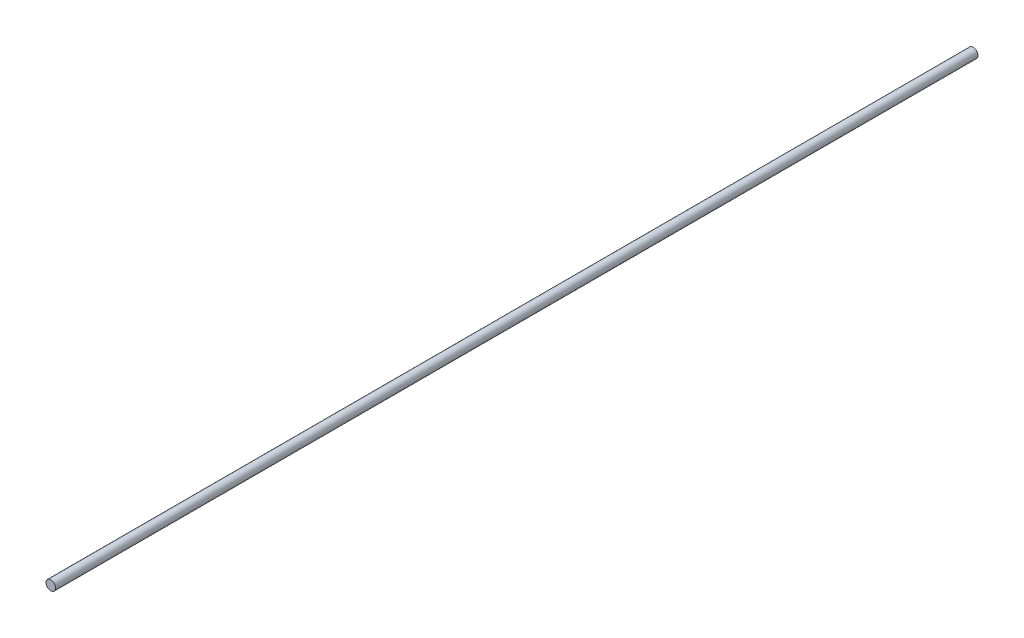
from build123d import *

# Parameters (mm, degrees)
SKETCH1_R           = 30
BOSS_EXTRUDE1_DEPTH = 5800


with BuildPart() as part:
    # Sketch1 → Boss-Extrude1 (new body)
    with BuildSketch(Plane.XY):
        Circle(SKETCH1_R)
    extrude(amount=-BOSS_EXTRUDE1_DEPTH)


solid = part.part
